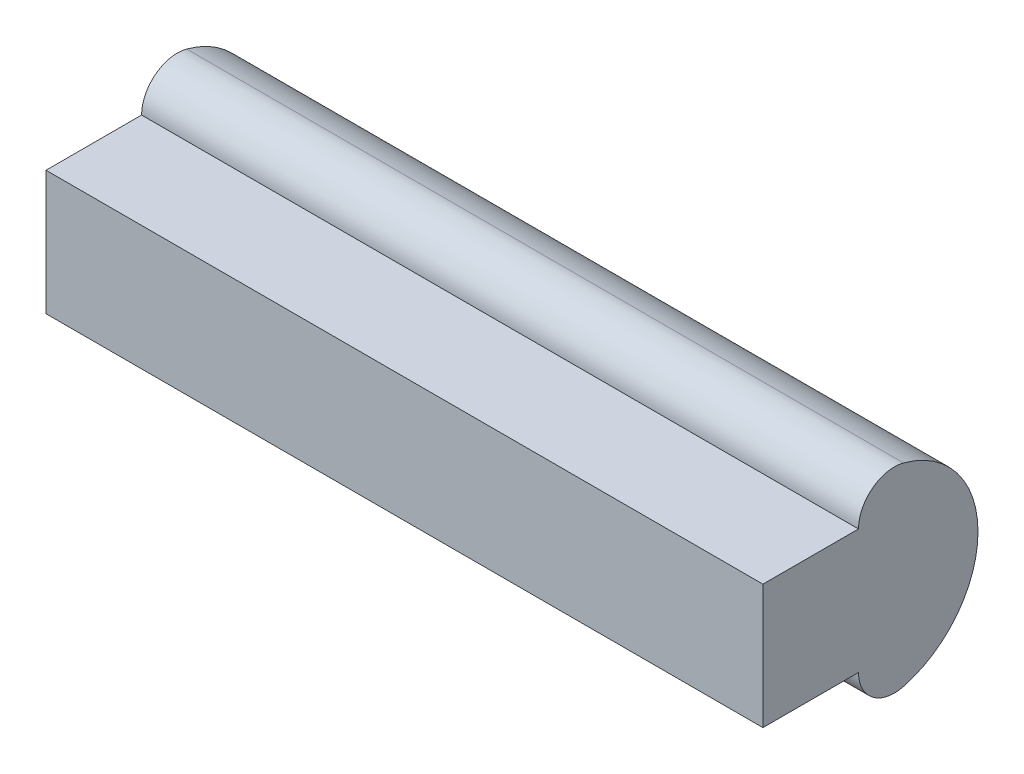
from build123d import *

# Parameters (mm, degrees)
CROQUIS1_W              = 40
CROQUIS1_H              = 52
SALIENTE_EXTRUIR1_DEPTH = 300


with BuildPart() as part:
    # Croquis1 → Saliente-Extruir1 (new body)
    with BuildSketch(Plane(origin=(0, 0, 0), x_dir=(0, 0, -1), z_dir=(1, 0, 0))):
        with Locations((20, 0)):
            Rectangle(CROQUIS1_W, CROQUIS1_H)
        with BuildLine():
            ThreePointArc((58.847583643, -40.498141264), (45.854338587, -37.889359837), (40, -26))
            Line((40, -26), (40, 26))
            ThreePointArc((40, 26), (45.854338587, 37.889359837), (58.847583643, 40.498141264))
            ThreePointArc((58.847583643, 40.498141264), (90, 0), (58.847583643, -40.498141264))
        make_face()
    extrude(amount=SALIENTE_EXTRUIR1_DEPTH)


solid = part.part
